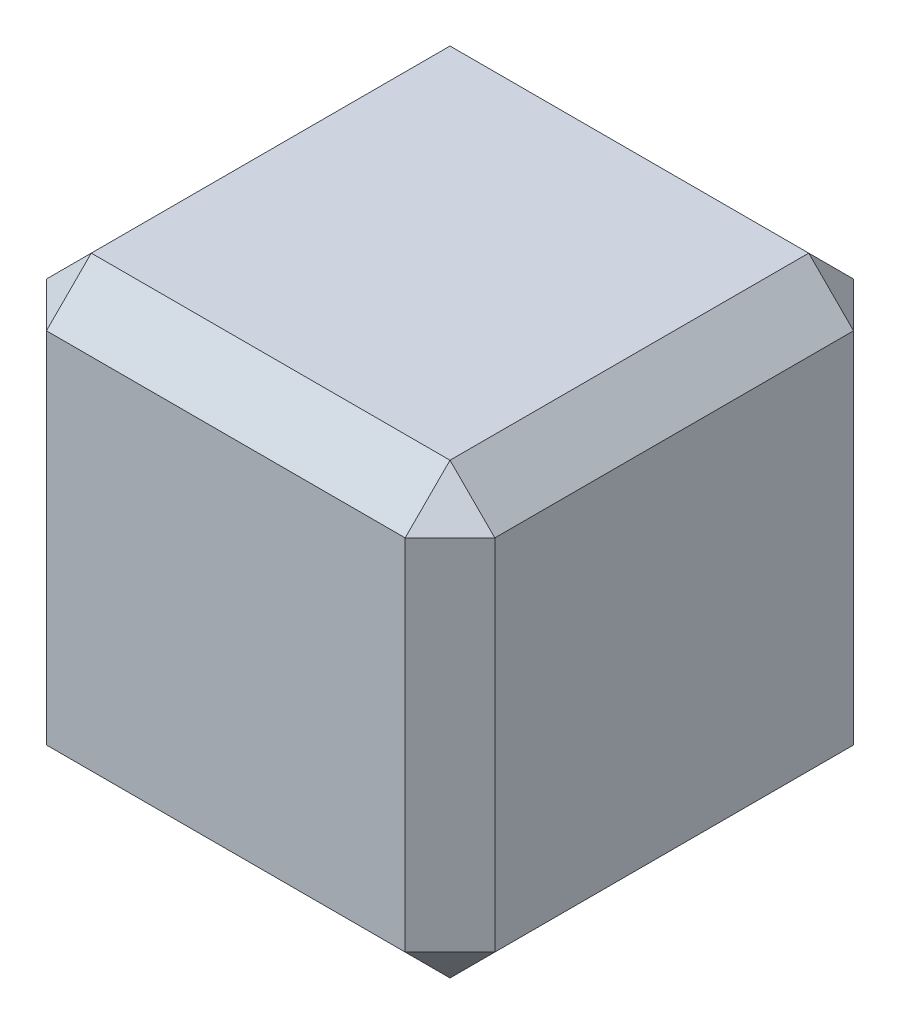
from build123d import *

# Parameters (mm, degrees)
SKETCH1_W           = 10
SKETCH1_H           = 10
BOSS_EXTRUDE1_DEPTH = 10
CHAMFER1_SIZE       = 1


with BuildPart() as part:
    # Sketch1 → Boss-Extrude1 (new body)
    with BuildSketch(Plane.XY):
        with Locations((5, 5)):
            Rectangle(SKETCH1_W, SKETCH1_H)
    extrude(amount=BOSS_EXTRUDE1_DEPTH)

    # Chamfer1
    chamfer1_edges = [part.edges().sort_by_distance(p)[0] for p in [
        (10, 5, 10),
        (5, 10, 10),
        (0, 5, 10),
        (5, 10, 0),
        (10, 5, 0),
        (5, 0, 0),
        (0, 5, 0),
        (0, 10, 5),
        (10, 10, 5),
        (10, 0, 5),
        (0, 0, 5),
        (5, 0, 10),
    ]]
    chamfer(chamfer1_edges, length=CHAMFER1_SIZE)


solid = part.part
